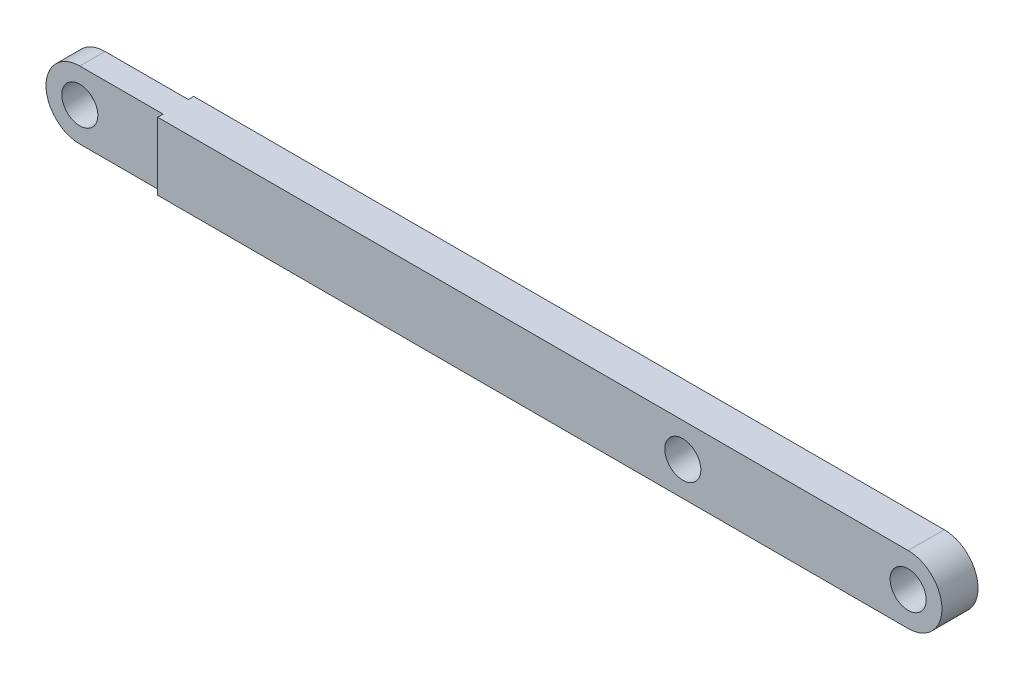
from build123d import *

# Parameters (mm, degrees)
SKETCH1_R           = 4
BOSS_EXTRUDE1_DEPTH = 8
SKETCH3_W           = 1.2
SKETCH3_H           = 15
CUT_EXTRUDE1_DEPTH  = 31


with BuildPart() as part:
    # Sketch1 → Boss-Extrude1 (new body)
    with BuildSketch(Plane.XY):
        with BuildLine():
            Line((-88.47826087, 7.5), (96.52173913, 7.5))
            ThreePointArc((96.52173913, 7.5), (104.02173913, 0), (96.52173913, -7.5))
            Line((96.52173913, -7.5), (-88.47826087, -7.5))
            ThreePointArc((-88.47826087, -7.5), (-95.97826087, 0), (-88.47826087, 7.5))
        make_face()
        with Locations((-88.47826087, 0)):
            Circle(SKETCH1_R, mode=Mode.SUBTRACT)
        with Locations((96.52173913, 0)):
            Circle(SKETCH1_R, mode=Mode.SUBTRACT)
        with Locations((46.52173913, 0)):
            Circle(SKETCH1_R, mode=Mode.SUBTRACT)
    extrude(amount=BOSS_EXTRUDE1_DEPTH)

    # Sketch3 → Cut-Extrude1 (cut)
    with BuildSketch(Plane(origin=(-70, 0, 0), x_dir=(0, 0, -1), z_dir=(1, 0, 0))):
        with Locations((-7.4, 0)):
            Rectangle(SKETCH3_W, SKETCH3_H)
        with Locations((-0.6, 0)):
            Rectangle(SKETCH3_W, SKETCH3_H)
    extrude(amount=-CUT_EXTRUDE1_DEPTH, mode=Mode.SUBTRACT)


solid = part.part
